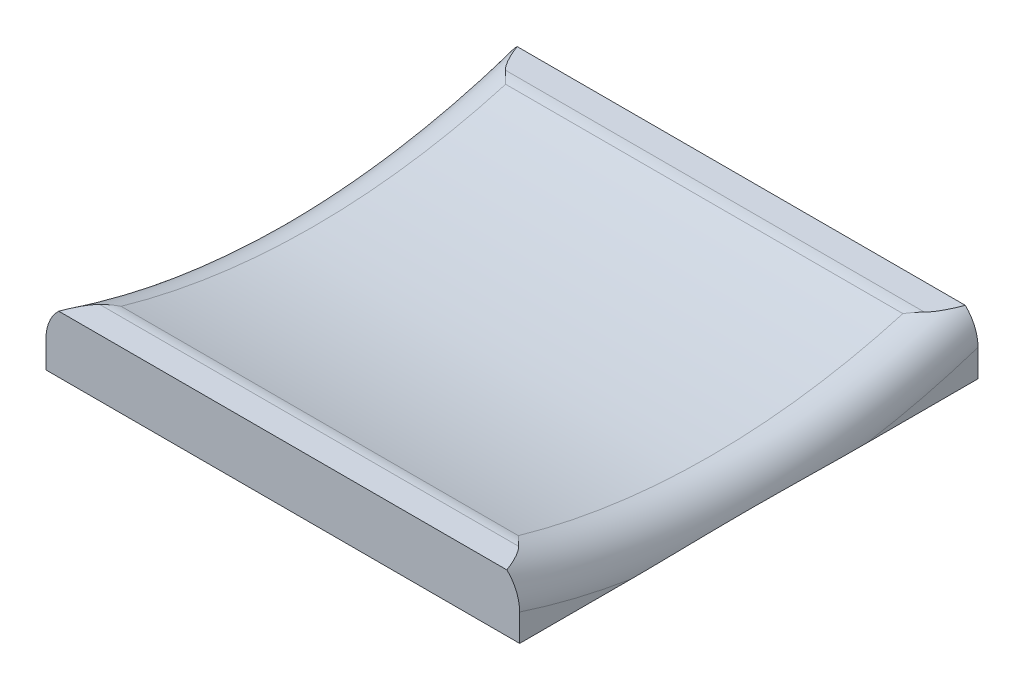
ISO-10303-21;
HEADER;
FILE_DESCRIPTION(('STEP AP214'),'2;1');
FILE_NAME('part.step','',(''),(''),'','','');
FILE_SCHEMA(('AUTOMOTIVE_DESIGN { 1 0 10303 214 1 1 1 1 }'));
ENDSEC;
DATA;
#1=APPLICATION_CONTEXT('core data for automotive mechanical design processes');
#2=APPLICATION_PROTOCOL_DEFINITION('international standard','automotive_design',2000,#1);
#3=PRODUCT_CONTEXT('',#1,'mechanical');
#4=PRODUCT('Part','Part','',(#3));
#5=PRODUCT_RELATED_PRODUCT_CATEGORY('part','',(#4));
#6=PRODUCT_DEFINITION_FORMATION('','',#4);
#7=PRODUCT_DEFINITION_CONTEXT('part definition',#1,'design');
#8=PRODUCT_DEFINITION('design','',#6,#7);
#9=PRODUCT_DEFINITION_SHAPE('','',#8);
#10=(LENGTH_UNIT() NAMED_UNIT(*) SI_UNIT(.MILLI.,.METRE.));
#11=(NAMED_UNIT(*) PLANE_ANGLE_UNIT() SI_UNIT($,.RADIAN.));
#12=(NAMED_UNIT(*) SI_UNIT($,.STERADIAN.) SOLID_ANGLE_UNIT());
#13=UNCERTAINTY_MEASURE_WITH_UNIT(LENGTH_MEASURE(1.E-05),#10,'distance_accuracy_value','');
#14=(GEOMETRIC_REPRESENTATION_CONTEXT(3) GLOBAL_UNCERTAINTY_ASSIGNED_CONTEXT((#13)) GLOBAL_UNIT_ASSIGNED_CONTEXT((#10,
#11,#12)) REPRESENTATION_CONTEXT('',''));
#15=CARTESIAN_POINT('',(0.,0.,0.));
#16=DIRECTION('',(0.,0.,1.));
#17=DIRECTION('',(1.,0.,0.));
#18=AXIS2_PLACEMENT_3D('',#15,#16,#17);
#19=CARTESIAN_POINT('',(78.74,0.,0.));
#20=DIRECTION('',(1.,0.,0.));
#21=DIRECTION('',(0.,0.,-1.));
#22=AXIS2_PLACEMENT_3D('',#19,#20,#21);
#23=PLANE('',#22);
#24=DIRECTION('',(0.,1.,0.));
#25=VECTOR('',#24,1.);
#26=CARTESIAN_POINT('',(78.74,9.525,-76.2));
#27=LINE('',#26,#25);
#28=CARTESIAN_POINT('',(78.74,-9.525,-76.2));
#29=VERTEX_POINT('',#28);
#30=CARTESIAN_POINT('',(78.74,-0.474716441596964,-76.2));
#31=VERTEX_POINT('',#30);
#32=EDGE_CURVE('E143',#29,#31,#27,.T.);
#33=ORIENTED_EDGE('',*,*,#32,.T.);
#34=CARTESIAN_POINT('',(78.74,230.889342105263,0.));
#35=DIRECTION('',(1.,0.,0.));
#36=DIRECTION('',(0.,0.,-1.));
#37=AXIS2_PLACEMENT_3D('',#34,#35,#36);
#38=CIRCLE('',#37,243.589342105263);
#39=CARTESIAN_POINT('',(78.74,-9.525,-39.2009144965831));
#40=VERTEX_POINT('',#39);
#41=EDGE_CURVE('E11',#31,#40,#38,.F.);
#42=ORIENTED_EDGE('',*,*,#41,.T.);
#43=DIRECTION('',(0.,0.,-1.));
#44=VECTOR('',#43,1.);
#45=CARTESIAN_POINT('',(78.74,-9.525,76.2));
#46=LINE('',#45,#44);
#47=EDGE_CURVE('E142',#40,#29,#46,.T.);
#48=ORIENTED_EDGE('',*,*,#47,.T.);
#49=EDGE_LOOP('',(#33,#42,#48));
#50=FACE_BOUND('',#49,.T.);
#51=ADVANCED_FACE('F41',(#50),#23,.T.);
#52=CARTESIAN_POINT('',(-78.74,0.,0.));
#53=DIRECTION('',(1.,0.,0.));
#54=DIRECTION('',(0.,0.,-1.));
#55=AXIS2_PLACEMENT_3D('',#52,#53,#54);
#56=PLANE('',#55);
#57=DIRECTION('',(0.,-1.,0.));
#58=VECTOR('',#57,1.);
#59=CARTESIAN_POINT('',(-78.74,9.525,76.2));
#60=LINE('',#59,#58);
#61=CARTESIAN_POINT('',(-78.74,-0.474716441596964,76.2));
#62=VERTEX_POINT('',#61);
#63=CARTESIAN_POINT('',(-78.74,-9.525,76.2));
#64=VERTEX_POINT('',#63);
#65=EDGE_CURVE('E150',#62,#64,#60,.T.);
#66=ORIENTED_EDGE('',*,*,#65,.F.);
#67=CARTESIAN_POINT('',(-78.74,230.889342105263,0.));
#68=DIRECTION('',(1.,0.,0.));
#69=DIRECTION('',(0.,0.,-1.));
#70=AXIS2_PLACEMENT_3D('',#67,#68,#69);
#71=CIRCLE('',#70,243.589342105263);
#72=CARTESIAN_POINT('',(-78.74,-9.525,39.2009144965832));
#73=VERTEX_POINT('',#72);
#74=EDGE_CURVE('E276',#62,#73,#71,.T.);
#75=ORIENTED_EDGE('',*,*,#74,.T.);
#76=DIRECTION('',(0.,0.,-1.));
#77=VECTOR('',#76,1.);
#78=CARTESIAN_POINT('',(-78.74,-9.525,76.2));
#79=LINE('',#78,#77);
#80=EDGE_CURVE('E171',#64,#73,#79,.T.);
#81=ORIENTED_EDGE('',*,*,#80,.F.);
#82=EDGE_LOOP('',(#66,#75,#81));
#83=FACE_BOUND('',#82,.T.);
#84=ADVANCED_FACE('F205',(#83),#56,.F.);
#85=CARTESIAN_POINT('',(78.74,9.525,76.2));
#86=DIRECTION('',(0.,-1.,0.));
#87=DIRECTION('',(0.,0.,-1.));
#88=AXIS2_PLACEMENT_3D('',#85,#86,#87);
#89=PLANE('',#88);
#90=DIRECTION('',(1.,0.,0.));
#91=VECTOR('',#90,1.);
#92=CARTESIAN_POINT('',(-78.74,9.525,67.4511033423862));
#93=LINE('',#92,#91);
#94=CARTESIAN_POINT('',(69.6481336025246,9.525,67.4511033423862));
#95=VERTEX_POINT('',#94);
#96=CARTESIAN_POINT('',(-69.6481336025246,9.525,67.4511033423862));
#97=VERTEX_POINT('',#96);
#98=EDGE_CURVE('E185',#95,#97,#93,.F.);
#99=ORIENTED_EDGE('',*,*,#98,.T.);
#100=CARTESIAN_POINT('',(-69.6481336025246,9.525,67.4511033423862));
#101=CARTESIAN_POINT('',(-69.7442889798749,9.525,67.5488738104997));
#102=CARTESIAN_POINT('',(-69.8384149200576,9.525,67.6485988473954));
#103=CARTESIAN_POINT('',(-70.0228799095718,9.525,67.8514411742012));
#104=CARTESIAN_POINT('',(-70.1132200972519,9.525,67.9545574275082));
#105=CARTESIAN_POINT('',(-70.3788033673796,9.525,68.2680118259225));
#106=CARTESIAN_POINT('',(-70.5488805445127,9.525,68.4827360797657));
#107=CARTESIAN_POINT('',(-70.8764771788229,9.525,68.9200956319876));
#108=CARTESIAN_POINT('',(-71.0340450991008,9.525,69.142695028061));
#109=CARTESIAN_POINT('',(-71.3390558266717,9.525,69.5948277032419));
#110=CARTESIAN_POINT('',(-71.4864945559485,9.525,69.8243637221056));
#111=CARTESIAN_POINT('',(-71.7709310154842,9.525,70.2864185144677));
#112=CARTESIAN_POINT('',(-71.9080233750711,9.525,70.5188793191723));
#113=CARTESIAN_POINT('',(-72.1744744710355,9.525,70.9881368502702));
#114=CARTESIAN_POINT('',(-72.3038342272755,9.525,71.2249329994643));
#115=CARTESIAN_POINT('',(-72.5557983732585,9.525,71.7024086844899));
#116=CARTESIAN_POINT('',(-72.6783953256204,9.525,71.9430921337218));
#117=CARTESIAN_POINT('',(-72.9173628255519,9.525,72.4275259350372));
#118=CARTESIAN_POINT('',(-73.0337333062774,9.525,72.6712763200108));
#119=CARTESIAN_POINT('',(-73.2713204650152,9.525,73.18408095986));
#120=CARTESIAN_POINT('',(-73.3919886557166,9.525,73.453388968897));
#121=CARTESIAN_POINT('',(-73.6271116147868,9.525,73.9945374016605));
#122=CARTESIAN_POINT('',(-73.7415694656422,9.525,74.2663764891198));
#123=CARTESIAN_POINT('',(-73.9654882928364,9.525,74.8139363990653));
#124=CARTESIAN_POINT('',(-74.0749165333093,9.525,75.0896705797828));
#125=CARTESIAN_POINT('',(-74.2885236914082,9.525,75.6433087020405));
#126=CARTESIAN_POINT('',(-74.3927002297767,9.525,75.921213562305));
#127=CARTESIAN_POINT('',(-74.49443146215,9.525,76.2));
#128=B_SPLINE_CURVE_WITH_KNOTS('',3,(#100,#101,#102,#103,#104,#105,#106,#107,#108,#109,#110,
#111,#112,#113,#114,#115,#116,#117,#118,#119,#120,#121,#122,#123,#124,#125,#126,#127),
.UNSPECIFIED.,.F.,.F.,(4,2,2,2,2,2,2,2,2,2,2,2,2,4),(0.,0.41131776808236,0.822510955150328,
1.64372907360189,2.46159230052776,3.27978289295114,4.08924231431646,4.89859473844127,
5.70882019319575,6.5190543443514,7.40428688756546,8.28907595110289,9.17898330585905,
10.0692902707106),.UNSPECIFIED.);
#129=CARTESIAN_POINT('',(-74.49443146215,9.525,76.2));
#130=VERTEX_POINT('',#129);
#131=EDGE_CURVE('E193',#97,#130,#128,.T.);
#132=ORIENTED_EDGE('',*,*,#131,.T.);
#133=DIRECTION('',(-1.,0.,0.));
#134=VECTOR('',#133,1.);
#135=CARTESIAN_POINT('',(78.74,9.525,76.2));
#136=LINE('',#135,#134);
#137=CARTESIAN_POINT('',(74.49443146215,9.525,76.2));
#138=VERTEX_POINT('',#137);
#139=EDGE_CURVE('E154',#138,#130,#136,.T.);
#140=ORIENTED_EDGE('',*,*,#139,.F.);
#141=CARTESIAN_POINT('',(74.49443146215,9.525,76.2));
#142=CARTESIAN_POINT('',(74.3798709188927,9.525,75.8860786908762));
#143=CARTESIAN_POINT('',(74.2622187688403,9.525,75.5732679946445));
#144=CARTESIAN_POINT('',(74.0200997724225,9.525,74.9502193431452));
#145=CARTESIAN_POINT('',(73.8956314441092,9.525,74.6399819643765));
#146=CARTESIAN_POINT('',(73.6386390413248,9.525,74.0209814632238));
#147=CARTESIAN_POINT('',(73.5060768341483,9.525,73.7122341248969));
#148=CARTESIAN_POINT('',(73.2326961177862,9.525,73.0984345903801));
#149=CARTESIAN_POINT('',(73.0918782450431,9.525,72.7933821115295));
#150=CARTESIAN_POINT('',(72.8042239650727,9.525,72.1944186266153));
#151=CARTESIAN_POINT('',(72.6575902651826,9.525,71.9004105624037));
#152=CARTESIAN_POINT('',(72.3543438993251,9.525,71.317592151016));
#153=CARTESIAN_POINT('',(72.1977320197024,9.525,71.0287813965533));
#154=CARTESIAN_POINT('',(71.8733708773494,9.525,70.4581777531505));
#155=CARTESIAN_POINT('',(71.7056431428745,9.525,70.1763726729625));
#156=CARTESIAN_POINT('',(71.3569823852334,9.525,69.6211024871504));
#157=CARTESIAN_POINT('',(71.176053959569,9.525,69.3476345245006));
#158=CARTESIAN_POINT('',(70.8863189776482,9.525,68.9362713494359));
#159=CARTESIAN_POINT('',(70.7830810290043,9.525,68.794445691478));
#160=CARTESIAN_POINT('',(70.5716769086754,9.525,68.5145224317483));
#161=CARTESIAN_POINT('',(70.463511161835,9.525,68.3764245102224));
#162=CARTESIAN_POINT('',(70.2411326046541,9.525,68.1038856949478));
#163=CARTESIAN_POINT('',(70.1268896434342,9.525,67.9694692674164));
#164=CARTESIAN_POINT('',(69.8922583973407,9.525,67.7059994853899));
#165=CARTESIAN_POINT('',(69.771866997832,9.525,67.5769489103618));
#166=CARTESIAN_POINT('',(69.6481336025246,9.525,67.4511033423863));
#167=B_SPLINE_CURVE_WITH_KNOTS('',3,(#141,#142,#143,#144,#145,#146,#147,#148,#149,#150,#151,
#152,#153,#154,#155,#156,#157,#158,#159,#160,#161,#162,#163,#164,#165,#166),.UNSPECIFIED.,.F.,
.F.,(4,2,2,2,2,2,2,2,2,2,2,2,4),(0.,1.00252334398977,2.00526552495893,3.01316395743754,
4.02098479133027,5.00645704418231,5.99185173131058,6.97539081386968,7.95858897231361,
8.48476337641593,9.01089250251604,9.53993312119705,10.0692444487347),.UNSPECIFIED.);
#168=EDGE_CURVE('E187',#138,#95,#167,.T.);
#169=ORIENTED_EDGE('',*,*,#168,.T.);
#170=EDGE_LOOP('',(#99,#132,#140,#169));
#171=FACE_BOUND('',#170,.T.);
#172=ADVANCED_FACE('F199',(#171),#89,.F.);
#173=DIRECTION('',(-1.,0.,0.));
#174=VECTOR('',#173,1.);
#175=CARTESIAN_POINT('',(78.74,9.525,-76.2));
#176=LINE('',#175,#174);
#177=CARTESIAN_POINT('',(74.49443146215,9.525,-76.2));
#178=VERTEX_POINT('',#177);
#179=CARTESIAN_POINT('',(-74.49443146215,9.525,-76.2));
#180=VERTEX_POINT('',#179);
#181=EDGE_CURVE('E174',#178,#180,#176,.T.);
#182=ORIENTED_EDGE('',*,*,#181,.T.);
#183=CARTESIAN_POINT('',(-74.49443146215,9.525,-76.2));
#184=CARTESIAN_POINT('',(-74.3798709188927,9.525,-75.8860786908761));
#185=CARTESIAN_POINT('',(-74.2622187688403,9.525,-75.5732679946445));
#186=CARTESIAN_POINT('',(-74.0200997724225,9.525,-74.9502193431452));
#187=CARTESIAN_POINT('',(-73.8956314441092,9.525,-74.6399819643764));
#188=CARTESIAN_POINT('',(-73.6386390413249,9.525,-74.0209814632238));
#189=CARTESIAN_POINT('',(-73.5060768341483,9.525,-73.7122341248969));
#190=CARTESIAN_POINT('',(-73.2326961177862,9.525,-73.0984345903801));
#191=CARTESIAN_POINT('',(-73.0918782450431,9.525,-72.7933821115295));
#192=CARTESIAN_POINT('',(-72.8042239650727,9.525,-72.1944186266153));
#193=CARTESIAN_POINT('',(-72.6575902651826,9.525,-71.9004105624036));
#194=CARTESIAN_POINT('',(-72.3543438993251,9.525,-71.3175921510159));
#195=CARTESIAN_POINT('',(-72.1977320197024,9.525,-71.0287813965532));
#196=CARTESIAN_POINT('',(-71.8733708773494,9.525,-70.4581777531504));
#197=CARTESIAN_POINT('',(-71.7056431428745,9.525,-70.1763726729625));
#198=CARTESIAN_POINT('',(-71.3569823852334,9.525,-69.6211024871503));
#199=CARTESIAN_POINT('',(-71.176053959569,9.525,-69.3476345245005));
#200=CARTESIAN_POINT('',(-70.8863189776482,9.525,-68.9362713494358));
#201=CARTESIAN_POINT('',(-70.7830810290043,9.525,-68.7944456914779));
#202=CARTESIAN_POINT('',(-70.5716769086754,9.525,-68.5145224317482));
#203=CARTESIAN_POINT('',(-70.463511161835,9.525,-68.3764245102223));
#204=CARTESIAN_POINT('',(-70.2411326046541,9.525,-68.1038856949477));
#205=CARTESIAN_POINT('',(-70.1268896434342,9.525,-67.9694692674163));
#206=CARTESIAN_POINT('',(-69.8922583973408,9.525,-67.7059994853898));
#207=CARTESIAN_POINT('',(-69.7718669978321,9.525,-67.5769489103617));
#208=CARTESIAN_POINT('',(-69.6481336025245,9.525,-67.4511033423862));
#209=B_SPLINE_CURVE_WITH_KNOTS('',3,(#183,#184,#185,#186,#187,#188,#189,#190,#191,#192,#193,
#194,#195,#196,#197,#198,#199,#200,#201,#202,#203,#204,#205,#206,#207,#208),.UNSPECIFIED.,.F.,
.F.,(4,2,2,2,2,2,2,2,2,2,2,2,4),(0.,1.00252334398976,2.00526552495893,3.01316395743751,
4.02098479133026,5.0064570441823,5.99185173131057,6.97539081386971,7.95858897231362,
8.48476337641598,9.0108925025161,9.53993312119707,10.0692444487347),.UNSPECIFIED.);
#210=CARTESIAN_POINT('',(-69.6481336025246,9.525,-67.4511033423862));
#211=VERTEX_POINT('',#210);
#212=EDGE_CURVE('E67',#180,#211,#209,.T.);
#213=ORIENTED_EDGE('',*,*,#212,.T.);
#214=DIRECTION('',(1.,0.,0.));
#215=VECTOR('',#214,1.);
#216=CARTESIAN_POINT('',(78.74,9.525,-67.4511033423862));
#217=LINE('',#216,#215);
#218=CARTESIAN_POINT('',(69.6481336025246,9.525,-67.4511033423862));
#219=VERTEX_POINT('',#218);
#220=EDGE_CURVE('E62',#211,#219,#217,.T.);
#221=ORIENTED_EDGE('',*,*,#220,.T.);
#222=CARTESIAN_POINT('',(69.6481336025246,9.525,-67.4511033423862));
#223=CARTESIAN_POINT('',(69.7442889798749,9.525,-67.5488738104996));
#224=CARTESIAN_POINT('',(69.8384149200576,9.525,-67.6485988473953));
#225=CARTESIAN_POINT('',(70.0228799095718,9.525,-67.8514411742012));
#226=CARTESIAN_POINT('',(70.1132200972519,9.525,-67.9545574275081));
#227=CARTESIAN_POINT('',(70.3788033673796,9.525,-68.2680118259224));
#228=CARTESIAN_POINT('',(70.5488805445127,9.525,-68.4827360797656));
#229=CARTESIAN_POINT('',(70.8764771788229,9.525,-68.9200956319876));
#230=CARTESIAN_POINT('',(71.0340450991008,9.525,-69.1426950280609));
#231=CARTESIAN_POINT('',(71.3390558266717,9.525,-69.5948277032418));
#232=CARTESIAN_POINT('',(71.4864945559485,9.525,-69.8243637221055));
#233=CARTESIAN_POINT('',(71.7709310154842,9.525,-70.2864185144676));
#234=CARTESIAN_POINT('',(71.9080233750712,9.525,-70.5188793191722));
#235=CARTESIAN_POINT('',(72.1744744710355,9.525,-70.9881368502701));
#236=CARTESIAN_POINT('',(72.3038342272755,9.525,-71.2249329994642));
#237=CARTESIAN_POINT('',(72.5557983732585,9.525,-71.7024086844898));
#238=CARTESIAN_POINT('',(72.6783953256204,9.525,-71.9430921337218));
#239=CARTESIAN_POINT('',(72.9173628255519,9.525,-72.4275259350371));
#240=CARTESIAN_POINT('',(73.0337333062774,9.525,-72.6712763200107));
#241=CARTESIAN_POINT('',(73.2713204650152,9.525,-73.1840809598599));
#242=CARTESIAN_POINT('',(73.3919886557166,9.525,-73.4533889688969));
#243=CARTESIAN_POINT('',(73.6271116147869,9.525,-73.9945374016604));
#244=CARTESIAN_POINT('',(73.7415694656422,9.525,-74.2663764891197));
#245=CARTESIAN_POINT('',(73.9654882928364,9.525,-74.8139363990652));
#246=CARTESIAN_POINT('',(74.0749165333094,9.525,-75.0896705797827));
#247=CARTESIAN_POINT('',(74.2885236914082,9.525,-75.6433087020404));
#248=CARTESIAN_POINT('',(74.3927002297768,9.525,-75.9212135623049));
#249=CARTESIAN_POINT('',(74.4944314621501,9.525,-76.2));
#250=B_SPLINE_CURVE_WITH_KNOTS('',3,(#222,#223,#224,#225,#226,#227,#228,#229,#230,#231,#232,
#233,#234,#235,#236,#237,#238,#239,#240,#241,#242,#243,#244,#245,#246,#247,#248,#249),
.UNSPECIFIED.,.F.,.F.,(4,2,2,2,2,2,2,2,2,2,2,2,2,4),(0.,0.41131776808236,0.822510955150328,
1.64372907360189,2.46159230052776,3.27978289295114,4.08924231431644,4.89859473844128,
5.70882019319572,6.51905434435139,7.40428688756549,8.28907595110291,9.17898330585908,
10.0692902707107),.UNSPECIFIED.);
#251=EDGE_CURVE('E216',#219,#178,#250,.T.);
#252=ORIENTED_EDGE('',*,*,#251,.T.);
#253=EDGE_LOOP('',(#182,#213,#221,#252));
#254=FACE_BOUND('',#253,.T.);
#255=ADVANCED_FACE('F204',(#254),#89,.F.);
#256=CARTESIAN_POINT('',(78.74,-9.525,76.2));
#257=VERTEX_POINT('',#256);
#258=CARTESIAN_POINT('',(78.74,-9.52499999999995,39.2009144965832));
#259=VERTEX_POINT('',#258);
#260=EDGE_CURVE('E138',#257,#259,#46,.T.);
#261=ORIENTED_EDGE('',*,*,#260,.T.);
#262=CARTESIAN_POINT('',(78.74,230.889342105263,0.));
#263=DIRECTION('',(1.,0.,0.));
#264=DIRECTION('',(0.,0.,-1.));
#265=AXIS2_PLACEMENT_3D('',#262,#263,#264);
#266=CIRCLE('',#265,243.589342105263);
#267=CARTESIAN_POINT('',(78.74,-0.474716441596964,76.2));
#268=VERTEX_POINT('',#267);
#269=EDGE_CURVE('E54',#259,#268,#266,.F.);
#270=ORIENTED_EDGE('',*,*,#269,.T.);
#271=DIRECTION('',(0.,-1.,0.));
#272=VECTOR('',#271,1.);
#273=CARTESIAN_POINT('',(78.74,9.525,76.2));
#274=LINE('',#273,#272);
#275=EDGE_CURVE('E134',#268,#257,#274,.T.);
#276=ORIENTED_EDGE('',*,*,#275,.T.);
#277=EDGE_LOOP('',(#261,#270,#276));
#278=FACE_BOUND('',#277,.T.);
#279=ADVANCED_FACE('F136',(#278),#23,.T.);
#280=CARTESIAN_POINT('',(-78.74,-9.52499999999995,-39.2009144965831));
#281=VERTEX_POINT('',#280);
#282=CARTESIAN_POINT('',(-78.74,-9.525,-76.2));
#283=VERTEX_POINT('',#282);
#284=EDGE_CURVE('E170',#281,#283,#79,.T.);
#285=ORIENTED_EDGE('',*,*,#284,.F.);
#286=CARTESIAN_POINT('',(-78.74,230.889342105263,0.));
#287=DIRECTION('',(1.,0.,0.));
#288=DIRECTION('',(0.,0.,-1.));
#289=AXIS2_PLACEMENT_3D('',#286,#287,#288);
#290=CIRCLE('',#289,243.589342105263);
#291=CARTESIAN_POINT('',(-78.74,-0.474716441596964,-76.2));
#292=VERTEX_POINT('',#291);
#293=EDGE_CURVE('E278',#281,#292,#290,.T.);
#294=ORIENTED_EDGE('',*,*,#293,.T.);
#295=DIRECTION('',(0.,1.,0.));
#296=VECTOR('',#295,1.);
#297=CARTESIAN_POINT('',(-78.74,9.525,-76.2));
#298=LINE('',#297,#296);
#299=EDGE_CURVE('E166',#283,#292,#298,.T.);
#300=ORIENTED_EDGE('',*,*,#299,.F.);
#301=EDGE_LOOP('',(#285,#294,#300));
#302=FACE_BOUND('',#301,.T.);
#303=ADVANCED_FACE('F287',(#302),#56,.F.);
#304=CARTESIAN_POINT('',(78.74,9.525,-76.2));
#305=DIRECTION('',(0.,0.,1.));
#306=DIRECTION('',(1.,0.,0.));
#307=AXIS2_PLACEMENT_3D('',#304,#305,#306);
#308=PLANE('',#307);
#309=ORIENTED_EDGE('',*,*,#299,.T.);
#310=CARTESIAN_POINT('',(-78.74,-0.474716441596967,-76.2));
#311=CARTESIAN_POINT('',(-78.7400274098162,-0.0824941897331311,-76.2));
#312=CARTESIAN_POINT('',(-78.7236092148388,0.309724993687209,-76.2));
#313=CARTESIAN_POINT('',(-78.6581259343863,1.0914563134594,-76.2));
#314=CARTESIAN_POINT('',(-78.6090585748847,1.48096825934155,-76.2));
#315=CARTESIAN_POINT('',(-78.4783626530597,2.2554692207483,-76.2));
#316=CARTESIAN_POINT('',(-78.3966552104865,2.64044493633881,-76.2));
#317=CARTESIAN_POINT('',(-78.2011329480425,3.40213381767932,-76.2));
#318=CARTESIAN_POINT('',(-78.0873201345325,3.77884749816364,-76.2));
#319=CARTESIAN_POINT('',(-77.8280295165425,4.52173267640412,-76.2));
#320=CARTESIAN_POINT('',(-77.6825136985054,4.88789091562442,-76.2));
#321=CARTESIAN_POINT('',(-77.3606851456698,5.60641091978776,-76.2));
#322=CARTESIAN_POINT('',(-77.1843734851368,5.95877316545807,-76.2));
#323=CARTESIAN_POINT('',(-76.8024001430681,6.64609773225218,-76.2));
#324=CARTESIAN_POINT('',(-76.5968106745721,6.98110017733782,-76.2));
#325=CARTESIAN_POINT('',(-76.157239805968,7.63172971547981,-76.2));
#326=CARTESIAN_POINT('',(-75.9232731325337,7.94736673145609,-76.2));
#327=CARTESIAN_POINT('',(-75.4931043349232,8.47694042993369,-76.2));
#328=CARTESIAN_POINT('',(-75.3030314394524,8.69588366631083,-76.2));
#329=CARTESIAN_POINT('',(-74.9090040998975,9.1205513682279,-76.2));
#330=CARTESIAN_POINT('',(-74.7050615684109,9.32628688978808,-76.2));
#331=CARTESIAN_POINT('',(-74.49443146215,9.525,-76.2));
#332=B_SPLINE_CURVE_WITH_KNOTS('',3,(#310,#311,#312,#313,#314,#315,#316,#317,#318,#319,#320,
#321,#322,#323,#324,#325,#326,#327,#328,#329,#330,#331),.UNSPECIFIED.,.F.,.F.,(4,2,2,2,2,2,2,2,
2,2,4),(0.,1.17631996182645,2.35272186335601,3.53198410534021,4.71117266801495,5.89178299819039,
7.07235215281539,8.25005833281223,9.4271559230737,10.296366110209,11.1648389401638),.UNSPECIFIED.);
#333=EDGE_CURVE('E262',#292,#180,#332,.T.);
#334=ORIENTED_EDGE('',*,*,#333,.T.);
#335=ORIENTED_EDGE('',*,*,#181,.F.);
#336=CARTESIAN_POINT('',(74.49443146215,9.525,-76.2));
#337=CARTESIAN_POINT('',(74.7706659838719,9.26442912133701,-76.2));
#338=CARTESIAN_POINT('',(75.0353912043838,8.99173322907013,-76.2));
#339=CARTESIAN_POINT('',(75.5402867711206,8.42461286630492,-76.2));
#340=CARTESIAN_POINT('',(75.780463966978,8.1301944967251,-76.2));
#341=CARTESIAN_POINT('',(76.2346346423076,7.52233505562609,-76.2));
#342=CARTESIAN_POINT('',(76.4486565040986,7.208915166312,-76.2));
#343=CARTESIAN_POINT('',(76.8496546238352,6.56522369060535,-76.2));
#344=CARTESIAN_POINT('',(77.0366300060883,6.23495155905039,-76.2));
#345=CARTESIAN_POINT('',(77.3824219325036,5.56026346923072,-76.2));
#346=CARTESIAN_POINT('',(77.5412567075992,5.21585684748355,-76.2));
#347=CARTESIAN_POINT('',(77.8301139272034,4.51516381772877,-76.2));
#348=CARTESIAN_POINT('',(77.9601357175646,4.15887714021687,-76.2));
#349=CARTESIAN_POINT('',(78.1906249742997,3.43719093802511,-76.2));
#350=CARTESIAN_POINT('',(78.2911159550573,3.07179891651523,-76.2));
#351=CARTESIAN_POINT('',(78.462161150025,2.33420542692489,-76.2));
#352=CARTESIAN_POINT('',(78.5327258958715,1.96200640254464,-76.2));
#353=CARTESIAN_POINT('',(78.638739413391,1.24603742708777,-76.2));
#354=CARTESIAN_POINT('',(78.6767275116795,0.902640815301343,-76.2));
#355=CARTESIAN_POINT('',(78.7273428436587,0.214592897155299,-76.2));
#356=CARTESIAN_POINT('',(78.7400146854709,-0.13005512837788,-76.2));
#357=CARTESIAN_POINT('',(78.74,-0.474716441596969,-76.2));
#358=B_SPLINE_CURVE_WITH_KNOTS('',3,(#336,#337,#338,#339,#340,#341,#342,#343,#344,#345,#346,
#347,#348,#349,#350,#351,#352,#353,#354,#355,#356,#357),.UNSPECIFIED.,.F.,.F.,(4,2,2,2,2,2,2,2,
2,2,4),(0.,1.13878120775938,2.27724378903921,3.41445979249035,4.55171260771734,5.68822593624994,
6.82476506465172,7.96039673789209,9.09562842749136,10.1311809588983,11.1649071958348),.UNSPECIFIED.);
#359=EDGE_CURVE('E266',#178,#31,#358,.T.);
#360=ORIENTED_EDGE('',*,*,#359,.T.);
#361=ORIENTED_EDGE('',*,*,#32,.F.);
#362=DIRECTION('',(-1.,0.,0.));
#363=VECTOR('',#362,1.);
#364=CARTESIAN_POINT('',(78.74,-9.525,-76.2));
#365=LINE('',#364,#363);
#366=EDGE_CURVE('E155',#29,#283,#365,.T.);
#367=ORIENTED_EDGE('',*,*,#366,.T.);
#368=EDGE_LOOP('',(#309,#334,#335,#360,#361,#367));
#369=FACE_BOUND('',#368,.T.);
#370=ADVANCED_FACE('F209',(#369),#308,.F.);
#371=CARTESIAN_POINT('',(78.74,9.525,76.2));
#372=DIRECTION('',(0.,0.,-1.));
#373=DIRECTION('',(-1.,0.,0.));
#374=AXIS2_PLACEMENT_3D('',#371,#372,#373);
#375=PLANE('',#374);
#376=ORIENTED_EDGE('',*,*,#139,.T.);
#377=CARTESIAN_POINT('',(-74.49443146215,9.525,76.2));
#378=CARTESIAN_POINT('',(-74.7706659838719,9.26442912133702,76.2));
#379=CARTESIAN_POINT('',(-75.0353912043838,8.99173322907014,76.2));
#380=CARTESIAN_POINT('',(-75.5402867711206,8.42461286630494,76.2));
#381=CARTESIAN_POINT('',(-75.780463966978,8.13019449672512,76.2));
#382=CARTESIAN_POINT('',(-76.2346346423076,7.52233505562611,76.2));
#383=CARTESIAN_POINT('',(-76.4486565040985,7.20891516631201,76.2));
#384=CARTESIAN_POINT('',(-76.8496546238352,6.56522369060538,76.2));
#385=CARTESIAN_POINT('',(-77.0366300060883,6.23495155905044,76.2));
#386=CARTESIAN_POINT('',(-77.3824219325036,5.56026346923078,76.2));
#387=CARTESIAN_POINT('',(-77.5412567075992,5.21585684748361,76.2));
#388=CARTESIAN_POINT('',(-77.8301139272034,4.51516381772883,76.2));
#389=CARTESIAN_POINT('',(-77.9601357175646,4.15887714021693,76.2));
#390=CARTESIAN_POINT('',(-78.1906249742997,3.43719093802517,76.2));
#391=CARTESIAN_POINT('',(-78.2911159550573,3.0717989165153,76.2));
#392=CARTESIAN_POINT('',(-78.462161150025,2.33420542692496,76.2));
#393=CARTESIAN_POINT('',(-78.5327258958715,1.96200640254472,76.2));
#394=CARTESIAN_POINT('',(-78.638739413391,1.24603742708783,76.2));
#395=CARTESIAN_POINT('',(-78.6767275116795,0.902640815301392,76.2));
#396=CARTESIAN_POINT('',(-78.7273428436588,0.214592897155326,76.2));
#397=CARTESIAN_POINT('',(-78.7400146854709,-0.130055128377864,76.2));
#398=CARTESIAN_POINT('',(-78.74,-0.474716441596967,76.2));
#399=B_SPLINE_CURVE_WITH_KNOTS('',3,(#377,#378,#379,#380,#381,#382,#383,#384,#385,#386,#387,
#388,#389,#390,#391,#392,#393,#394,#395,#396,#397,#398),.UNSPECIFIED.,.F.,.F.,(4,2,2,2,2,2,2,2,
2,2,4),(0.,1.13878120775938,2.2772437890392,3.41445979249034,4.55171260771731,5.6882259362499,
6.82476506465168,7.96039673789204,9.09562842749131,10.1311809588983,11.1649071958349),.UNSPECIFIED.);
#400=EDGE_CURVE('E250',#130,#62,#399,.T.);
#401=ORIENTED_EDGE('',*,*,#400,.T.);
#402=ORIENTED_EDGE('',*,*,#65,.T.);
#403=DIRECTION('',(-1.,0.,0.));
#404=VECTOR('',#403,1.);
#405=CARTESIAN_POINT('',(78.74,-9.525,76.2));
#406=LINE('',#405,#404);
#407=EDGE_CURVE('E146',#257,#64,#406,.T.);
#408=ORIENTED_EDGE('',*,*,#407,.F.);
#409=ORIENTED_EDGE('',*,*,#275,.F.);
#410=CARTESIAN_POINT('',(78.74,-0.474716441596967,76.2));
#411=CARTESIAN_POINT('',(78.7400274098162,-0.0824941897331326,76.2));
#412=CARTESIAN_POINT('',(78.7236092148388,0.309724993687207,76.2));
#413=CARTESIAN_POINT('',(78.6581259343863,1.0914563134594,76.2));
#414=CARTESIAN_POINT('',(78.6090585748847,1.48096825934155,76.2));
#415=CARTESIAN_POINT('',(78.4783626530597,2.2554692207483,76.2));
#416=CARTESIAN_POINT('',(78.3966552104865,2.64044493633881,76.2));
#417=CARTESIAN_POINT('',(78.2011329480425,3.40213381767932,76.2));
#418=CARTESIAN_POINT('',(78.0873201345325,3.77884749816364,76.2));
#419=CARTESIAN_POINT('',(77.8280295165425,4.52173267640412,76.2));
#420=CARTESIAN_POINT('',(77.6825136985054,4.88789091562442,76.2));
#421=CARTESIAN_POINT('',(77.3606851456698,5.60641091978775,76.2));
#422=CARTESIAN_POINT('',(77.1843734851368,5.95877316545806,76.2));
#423=CARTESIAN_POINT('',(76.8024001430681,6.64609773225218,76.2));
#424=CARTESIAN_POINT('',(76.5968106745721,6.98110017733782,76.2));
#425=CARTESIAN_POINT('',(76.157239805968,7.63172971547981,76.2));
#426=CARTESIAN_POINT('',(75.9232731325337,7.94736673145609,76.2));
#427=CARTESIAN_POINT('',(75.4931043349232,8.47694042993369,76.2));
#428=CARTESIAN_POINT('',(75.3030314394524,8.69588366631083,76.2));
#429=CARTESIAN_POINT('',(74.9090040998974,9.1205513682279,76.2));
#430=CARTESIAN_POINT('',(74.7050615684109,9.32628688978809,76.2));
#431=CARTESIAN_POINT('',(74.49443146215,9.52500000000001,76.2));
#432=B_SPLINE_CURVE_WITH_KNOTS('',3,(#410,#411,#412,#413,#414,#415,#416,#417,#418,#419,#420,
#421,#422,#423,#424,#425,#426,#427,#428,#429,#430,#431),.UNSPECIFIED.,.F.,.F.,(4,2,2,2,2,2,2,2,
2,2,4),(0.,1.17631996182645,2.35272186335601,3.53198410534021,4.71117266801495,5.89178299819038,
7.07235215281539,8.25005833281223,9.42715592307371,10.296366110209,11.1648389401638),.UNSPECIFIED.);
#433=EDGE_CURVE('E310',#268,#138,#432,.T.);
#434=ORIENTED_EDGE('',*,*,#433,.T.);
#435=EDGE_LOOP('',(#376,#401,#402,#408,#409,#434));
#436=FACE_BOUND('',#435,.T.);
#437=ADVANCED_FACE('F148',(#436),#375,.F.);
#438=CARTESIAN_POINT('',(78.74,-9.525,76.2));
#439=DIRECTION('',(0.,1.,0.));
#440=DIRECTION('',(0.,0.,1.));
#441=AXIS2_PLACEMENT_3D('',#438,#439,#440);
#442=PLANE('',#441);
#443=ORIENTED_EDGE('',*,*,#80,.T.);
#444=CARTESIAN_POINT('',(-78.74,-9.52499999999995,39.2009144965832));
#445=CARTESIAN_POINT('',(-78.739976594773,-9.52499999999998,38.1424218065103));
#446=CARTESIAN_POINT('',(-78.7365724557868,-9.52499999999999,37.0839375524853));
#447=CARTESIAN_POINT('',(-78.7244514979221,-9.525,34.9670116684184));
#448=CARTESIAN_POINT('',(-78.7157347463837,-9.525,33.9085700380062));
#449=CARTESIAN_POINT('',(-78.694437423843,-9.525,31.7917429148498));
#450=CARTESIAN_POINT('',(-78.681856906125,-9.525,30.7333574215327));
#451=CARTESIAN_POINT('',(-78.6541263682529,-9.525,28.616617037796));
#452=CARTESIAN_POINT('',(-78.6389763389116,-9.525,27.5582621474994));
#453=CARTESIAN_POINT('',(-78.6072973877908,-9.525,25.4416591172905));
#454=CARTESIAN_POINT('',(-78.5907685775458,-9.525,24.3834109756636));
#455=CARTESIAN_POINT('',(-78.5574038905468,-9.525,22.2669212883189));
#456=CARTESIAN_POINT('',(-78.5405680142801,-9.525,21.2086797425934));
#457=CARTESIAN_POINT('',(-78.5075467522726,-9.525,19.0921988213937));
#458=CARTESIAN_POINT('',(-78.4913613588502,-9.525,18.0339594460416));
#459=CARTESIAN_POINT('',(-78.4604765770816,-9.525,15.9174563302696));
#460=CARTESIAN_POINT('',(-78.4457771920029,-9.525,14.8591925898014));
#461=CARTESIAN_POINT('',(-78.4179843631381,-9.525,12.6968107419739));
#462=CARTESIAN_POINT('',(-78.4049880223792,-9.525,11.592691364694));
#463=CARTESIAN_POINT('',(-78.3820326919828,-9.525,9.3844205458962));
#464=CARTESIAN_POINT('',(-78.3720737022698,-9.525,8.28026910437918));
#465=CARTESIAN_POINT('',(-78.3556718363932,-9.525,6.07194274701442));
#466=CARTESIAN_POINT('',(-78.3492289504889,-9.525,4.96776783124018));
#467=CARTESIAN_POINT('',(-78.3401622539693,-9.525,2.75940211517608));
#468=CARTESIAN_POINT('',(-78.3375384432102,-9.525,1.65521131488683));
#469=CARTESIAN_POINT('',(-78.3362318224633,-9.525,-0.553223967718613));
#470=CARTESIAN_POINT('',(-78.3375491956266,-9.525,-1.65746845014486));
#471=CARTESIAN_POINT('',(-78.3440641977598,-9.525,-3.86594579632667));
#472=CARTESIAN_POINT('',(-78.3492618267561,-9.525,-4.97017866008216));
#473=CARTESIAN_POINT('',(-78.363294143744,-9.525,-7.17862394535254));
#474=CARTESIAN_POINT('',(-78.3721288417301,-9.525,-8.28283636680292));
#475=CARTESIAN_POINT('',(-78.3930141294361,-9.525,-10.4912309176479));
#476=CARTESIAN_POINT('',(-78.4050647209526,-9.525,-11.5954130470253));
#477=CARTESIAN_POINT('',(-78.4317905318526,-9.525,-13.8038455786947));
#478=CARTESIAN_POINT('',(-78.4464659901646,-9.525,-14.9080959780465));
#479=CARTESIAN_POINT('',(-78.4776851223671,-9.525,-17.1165696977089));
#480=CARTESIAN_POINT('',(-78.4942287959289,-9.525,-18.2207930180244));
#481=CARTESIAN_POINT('',(-78.5282746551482,-9.525,-20.4292204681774));
#482=CARTESIAN_POINT('',(-78.5457768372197,-9.525,-21.5334245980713));
#483=CARTESIAN_POINT('',(-78.5806843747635,-9.525,-23.7418343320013));
#484=CARTESIAN_POINT('',(-78.5980897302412,-9.525,-24.8460399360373));
#485=CARTESIAN_POINT('',(-78.6316090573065,-9.525,-27.0543958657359));
#486=CARTESIAN_POINT('',(-78.6477231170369,-9.525,-28.1585461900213));
#487=CARTESIAN_POINT('',(-78.6773300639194,-9.525,-30.3668786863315));
#488=CARTESIAN_POINT('',(-78.6908229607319,-9.525,-31.4710608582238));
#489=CARTESIAN_POINT('',(-78.7137326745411,-9.525,-33.6794961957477));
#490=CARTESIAN_POINT('',(-78.7231493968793,-9.525,-34.7837493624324));
#491=CARTESIAN_POINT('',(-78.7362692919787,-9.525,-36.9923032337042));
#492=CARTESIAN_POINT('',(-78.7399723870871,-9.525,-38.0966039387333));
#493=CARTESIAN_POINT('',(-78.74,-9.525,-39.2009144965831));
#494=B_SPLINE_CURVE_WITH_KNOTS('',3,(#444,#445,#446,#447,#448,#449,#450,#451,#452,#453,#454,
#455,#456,#457,#458,#459,#460,#461,#462,#463,#464,#465,#466,#467,#468,#469,#470,#471,#472,#473,
#474,#475,#476,#477,#478,#479,#480,#481,#482,#483,#484,#485,#486,#487,#488,#489,#490,#491,#492,
#493),.UNSPECIFIED.,.F.,.F.,(4,2,2,2,2,2,2,2,2,2,2,2,2,2,2,2,2,2,2,2,2,2,2,2,4),(0.,
3.17546076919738,6.3508812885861,9.52625801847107,12.7016461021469,15.8767775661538,
19.0519039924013,22.2269929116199,25.4020888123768,28.7146730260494,32.0272571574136,
35.3398321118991,38.6524069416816,41.965135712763,45.2778645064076,48.5906024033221,
51.9033421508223,55.2163835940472,58.5294244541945,61.8424529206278,65.1554812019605,
68.4682831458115,71.7810728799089,75.0939395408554,78.4068512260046),.UNSPECIFIED.);
#495=EDGE_CURVE('E256',#73,#281,#494,.T.);
#496=ORIENTED_EDGE('',*,*,#495,.T.);
#497=ORIENTED_EDGE('',*,*,#284,.T.);
#498=ORIENTED_EDGE('',*,*,#366,.F.);
#499=ORIENTED_EDGE('',*,*,#47,.F.);
#500=CARTESIAN_POINT('',(78.74,-9.52499999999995,-39.2009144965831));
#501=CARTESIAN_POINT('',(78.739976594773,-9.52499999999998,-38.1424218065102));
#502=CARTESIAN_POINT('',(78.7365724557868,-9.52499999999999,-37.0839375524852));
#503=CARTESIAN_POINT('',(78.7244514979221,-9.525,-34.9670116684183));
#504=CARTESIAN_POINT('',(78.7157347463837,-9.525,-33.9085700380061));
#505=CARTESIAN_POINT('',(78.694437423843,-9.525,-31.7917429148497));
#506=CARTESIAN_POINT('',(78.681856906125,-9.525,-30.7333574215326));
#507=CARTESIAN_POINT('',(78.6541263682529,-9.525,-28.6166170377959));
#508=CARTESIAN_POINT('',(78.6389763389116,-9.525,-27.5582621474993));
#509=CARTESIAN_POINT('',(78.6072973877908,-9.525,-25.4416591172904));
#510=CARTESIAN_POINT('',(78.5907685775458,-9.525,-24.3834109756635));
#511=CARTESIAN_POINT('',(78.5574038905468,-9.525,-22.2669212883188));
#512=CARTESIAN_POINT('',(78.5405680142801,-9.525,-21.2086797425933));
#513=CARTESIAN_POINT('',(78.5075467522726,-9.525,-19.0921988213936));
#514=CARTESIAN_POINT('',(78.4913613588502,-9.525,-18.0339594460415));
#515=CARTESIAN_POINT('',(78.4604765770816,-9.525,-15.9174563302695));
#516=CARTESIAN_POINT('',(78.4457771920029,-9.525,-14.8591925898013));
#517=CARTESIAN_POINT('',(78.4179843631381,-9.525,-12.6968107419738));
#518=CARTESIAN_POINT('',(78.4049880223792,-9.525,-11.5926913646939));
#519=CARTESIAN_POINT('',(78.3820326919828,-9.525,-9.3844205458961));
#520=CARTESIAN_POINT('',(78.3720737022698,-9.525,-8.28026910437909));
#521=CARTESIAN_POINT('',(78.3556718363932,-9.525,-6.07194274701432));
#522=CARTESIAN_POINT('',(78.3492289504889,-9.525,-4.96776783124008));
#523=CARTESIAN_POINT('',(78.3401622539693,-9.525,-2.75940211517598));
#524=CARTESIAN_POINT('',(78.3375384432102,-9.525,-1.65521131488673));
#525=CARTESIAN_POINT('',(78.3362318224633,-9.525,0.553223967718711));
#526=CARTESIAN_POINT('',(78.3375491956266,-9.525,1.65746845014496));
#527=CARTESIAN_POINT('',(78.3440641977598,-9.525,3.86594579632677));
#528=CARTESIAN_POINT('',(78.3492618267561,-9.525,4.97017866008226));
#529=CARTESIAN_POINT('',(78.363294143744,-9.525,7.17862394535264));
#530=CARTESIAN_POINT('',(78.3721288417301,-9.525,8.28283636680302));
#531=CARTESIAN_POINT('',(78.3930141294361,-9.525,10.491230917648));
#532=CARTESIAN_POINT('',(78.4050647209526,-9.525,11.5954130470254));
#533=CARTESIAN_POINT('',(78.4317905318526,-9.525,13.8038455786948));
#534=CARTESIAN_POINT('',(78.4464659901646,-9.525,14.9080959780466));
#535=CARTESIAN_POINT('',(78.4776851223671,-9.525,17.116569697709));
#536=CARTESIAN_POINT('',(78.4942287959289,-9.525,18.2207930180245));
#537=CARTESIAN_POINT('',(78.5282746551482,-9.525,20.4292204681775));
#538=CARTESIAN_POINT('',(78.5457768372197,-9.525,21.5334245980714));
#539=CARTESIAN_POINT('',(78.5806843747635,-9.525,23.7418343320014));
#540=CARTESIAN_POINT('',(78.5980897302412,-9.525,24.8460399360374));
#541=CARTESIAN_POINT('',(78.6316090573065,-9.525,27.054395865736));
#542=CARTESIAN_POINT('',(78.6477231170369,-9.525,28.1585461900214));
#543=CARTESIAN_POINT('',(78.6773300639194,-9.525,30.3668786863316));
#544=CARTESIAN_POINT('',(78.6908229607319,-9.525,31.4710608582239));
#545=CARTESIAN_POINT('',(78.7137326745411,-9.525,33.6794961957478));
#546=CARTESIAN_POINT('',(78.7231493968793,-9.525,34.7837493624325));
#547=CARTESIAN_POINT('',(78.7362692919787,-9.525,36.9923032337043));
#548=CARTESIAN_POINT('',(78.7399723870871,-9.525,38.0966039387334));
#549=CARTESIAN_POINT('',(78.74,-9.525,39.2009144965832));
#550=B_SPLINE_CURVE_WITH_KNOTS('',3,(#500,#501,#502,#503,#504,#505,#506,#507,#508,#509,#510,
#511,#512,#513,#514,#515,#516,#517,#518,#519,#520,#521,#522,#523,#524,#525,#526,#527,#528,#529,
#530,#531,#532,#533,#534,#535,#536,#537,#538,#539,#540,#541,#542,#543,#544,#545,#546,#547,#548,
#549),.UNSPECIFIED.,.F.,.F.,(4,2,2,2,2,2,2,2,2,2,2,2,2,2,2,2,2,2,2,2,2,2,2,2,4),(0.,
3.17546076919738,6.3508812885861,9.52625801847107,12.7016461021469,15.8767775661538,
19.0519039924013,22.2269929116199,25.4020888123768,28.7146730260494,32.0272571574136,
35.3398321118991,38.6524069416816,41.965135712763,45.2778645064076,48.5906024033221,
51.9033421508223,55.2163835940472,58.5294244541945,61.8424529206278,65.1554812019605,
68.4682831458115,71.7810728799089,75.0939395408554,78.4068512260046),.UNSPECIFIED.);
#551=EDGE_CURVE('E160',#40,#259,#550,.T.);
#552=ORIENTED_EDGE('',*,*,#551,.T.);
#553=ORIENTED_EDGE('',*,*,#260,.F.);
#554=ORIENTED_EDGE('',*,*,#407,.T.);
#555=EDGE_LOOP('',(#443,#496,#497,#498,#499,#552,#553,#554));
#556=FACE_BOUND('',#555,.T.);
#557=ADVANCED_FACE('F157',(#556),#442,.F.);
#558=CARTESIAN_POINT('',(373.392648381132,230.889342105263,0.));
#559=DIRECTION('',(-1.,0.,0.));
#560=DIRECTION('',(0.,0.,1.));
#561=AXIS2_PLACEMENT_3D('',#558,#559,#560);
#562=CYLINDRICAL_SURFACE('',#561,230.889342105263);
#563=CARTESIAN_POINT('',(66.04,230.889342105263,0.));
#564=DIRECTION('',(1.,0.,0.));
#565=DIRECTION('',(0.,0.,-1.));
#566=AXIS2_PLACEMENT_3D('',#563,#564,#565);
#567=CIRCLE('',#566,230.889342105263);
#568=CARTESIAN_POINT('',(66.04,9.02839576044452,63.9344100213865));
#569=VERTEX_POINT('',#568);
#570=CARTESIAN_POINT('',(66.04,9.02839576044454,-63.9344100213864));
#571=VERTEX_POINT('',#570);
#572=EDGE_CURVE('E178',#569,#571,#567,.T.);
#573=ORIENTED_EDGE('',*,*,#572,.T.);
#574=DIRECTION('',(-1.,0.,0.));
#575=VECTOR('',#574,1.);
#576=CARTESIAN_POINT('',(373.392648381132,9.02839576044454,-63.9344100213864));
#577=LINE('',#576,#575);
#578=CARTESIAN_POINT('',(-66.04,9.02839576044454,-63.9344100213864));
#579=VERTEX_POINT('',#578);
#580=EDGE_CURVE('E183',#571,#579,#577,.T.);
#581=ORIENTED_EDGE('',*,*,#580,.T.);
#582=CARTESIAN_POINT('',(-66.04,230.889342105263,0.));
#583=DIRECTION('',(1.,0.,0.));
#584=DIRECTION('',(0.,0.,-1.));
#585=AXIS2_PLACEMENT_3D('',#582,#583,#584);
#586=CIRCLE('',#585,230.889342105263);
#587=CARTESIAN_POINT('',(-66.04,9.02839576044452,63.9344100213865));
#588=VERTEX_POINT('',#587);
#589=EDGE_CURVE('E180',#579,#588,#586,.F.);
#590=ORIENTED_EDGE('',*,*,#589,.T.);
#591=DIRECTION('',(-1.,0.,0.));
#592=VECTOR('',#591,1.);
#593=CARTESIAN_POINT('',(373.392648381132,9.02839576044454,63.9344100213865));
#594=LINE('',#593,#592);
#595=EDGE_CURVE('E176',#588,#569,#594,.F.);
#596=ORIENTED_EDGE('',*,*,#595,.T.);
#597=EDGE_LOOP('',(#573,#581,#590,#596));
#598=FACE_BOUND('',#597,.T.);
#599=ADVANCED_FACE('F286',(#598),#562,.F.);
#600=CARTESIAN_POINT('',(66.04,230.889342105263,0.));
#601=DIRECTION('',(1.,0.,0.));
#602=DIRECTION('',(0.,0.,-1.));
#603=AXIS2_PLACEMENT_3D('',#600,#601,#602);
#604=TOROIDAL_SURFACE('',#603,243.589342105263,12.7);
#605=ORIENTED_EDGE('',*,*,#359,.F.);
#606=ORIENTED_EDGE('',*,*,#251,.F.);
#607=CARTESIAN_POINT('',(69.6481336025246,9.525,-67.4511033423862));
#608=CARTESIAN_POINT('',(69.3524065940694,9.52497566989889,-67.1504729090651));
#609=CARTESIAN_POINT('',(69.0550374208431,9.51432530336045,-66.8514917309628));
#610=CARTESIAN_POINT('',(68.4578173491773,9.47228665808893,-66.2573676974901));
#611=CARTESIAN_POINT('',(68.1579659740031,9.44089429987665,-65.9622256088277));
#612=CARTESIAN_POINT('',(67.5581340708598,9.35808407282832,-65.3778343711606));
#613=CARTESIAN_POINT('',(67.2581609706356,9.30676236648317,-65.0885638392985));
#614=CARTESIAN_POINT('',(66.6574940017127,9.18443989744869,-64.5150892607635));
#615=CARTESIAN_POINT('',(66.3568003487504,9.11344443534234,-64.2308838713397));
#616=CARTESIAN_POINT('',(66.050766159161,9.03129508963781,-63.9444828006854));
#617=CARTESIAN_POINT('',(66.0453830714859,9.02984698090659,-63.9394459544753));
#618=CARTESIAN_POINT('',(66.04,9.02839576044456,-63.9344100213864));
#619=B_SPLINE_CURVE_WITH_KNOTS('',3,(#607,#608,#609,#610,#611,#612,#613,#614,#615,#616,#617,
#618),.UNSPECIFIED.,.F.,.F.,(4,2,2,2,2,4),(0.,1.26493603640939,2.53012093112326,
3.78927546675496,5.04809108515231,5.07062994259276),.UNSPECIFIED.);
#620=EDGE_CURVE('E46',#571,#219,#619,.F.);
#621=ORIENTED_EDGE('',*,*,#620,.F.);
#622=ORIENTED_EDGE('',*,*,#572,.F.);
#623=CARTESIAN_POINT('',(69.6481336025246,9.525,67.4511033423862));
#624=CARTESIAN_POINT('',(69.352406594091,9.5249756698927,67.1504729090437));
#625=CARTESIAN_POINT('',(69.0550374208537,9.51432530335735,66.851491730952));
#626=CARTESIAN_POINT('',(68.4578173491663,9.47228665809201,66.2573676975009));
#627=CARTESIAN_POINT('',(68.1579659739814,9.44089429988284,65.9622256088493));
#628=CARTESIAN_POINT('',(67.5581340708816,9.35808407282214,65.3778343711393));
#629=CARTESIAN_POINT('',(67.2581609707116,9.30676236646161,65.0885638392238));
#630=CARTESIAN_POINT('',(66.6574940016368,9.18443989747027,64.5150892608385));
#631=CARTESIAN_POINT('',(66.3568003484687,9.11344443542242,64.2308838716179));
#632=CARTESIAN_POINT('',(66.050766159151,9.03129508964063,63.9444828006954));
#633=CARTESIAN_POINT('',(66.0453830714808,9.02984698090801,63.9394459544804));
#634=CARTESIAN_POINT('',(66.04,9.02839576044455,63.9344100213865));
#635=B_SPLINE_CURVE_WITH_KNOTS('',3,(#623,#624,#625,#626,#627,#628,#629,#630,#631,#632,#633,
#634),.UNSPECIFIED.,.F.,.F.,(4,2,2,2,2,4),(0.,1.26493603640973,2.53012093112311,
3.78927546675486,5.04809108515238,5.07062994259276),.UNSPECIFIED.);
#636=EDGE_CURVE('E329',#95,#569,#635,.T.);
#637=ORIENTED_EDGE('',*,*,#636,.F.);
#638=ORIENTED_EDGE('',*,*,#168,.F.);
#639=ORIENTED_EDGE('',*,*,#433,.F.);
#640=ORIENTED_EDGE('',*,*,#269,.F.);
#641=ORIENTED_EDGE('',*,*,#551,.F.);
#642=ORIENTED_EDGE('',*,*,#41,.F.);
#643=EDGE_LOOP('',(#605,#606,#621,#622,#637,#638,#639,#640,#641,#642));
#644=FACE_BOUND('',#643,.T.);
#645=ADVANCED_FACE('F43',(#644),#604,.T.);
#646=CARTESIAN_POINT('',(373.392648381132,-3.17499999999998,-67.4511033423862));
#647=DIRECTION('',(-1.,0.,0.));
#648=DIRECTION('',(0.,0.,1.));
#649=AXIS2_PLACEMENT_3D('',#646,#647,#648);
#650=CYLINDRICAL_SURFACE('',#649,12.7);
#651=ORIENTED_EDGE('',*,*,#620,.T.);
#652=ORIENTED_EDGE('',*,*,#220,.F.);
#653=CARTESIAN_POINT('',(-69.6481336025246,9.525,-67.4511033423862));
#654=CARTESIAN_POINT('',(-69.3524065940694,9.52497566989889,-67.1504729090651));
#655=CARTESIAN_POINT('',(-69.0550374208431,9.51432530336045,-66.8514917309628));
#656=CARTESIAN_POINT('',(-68.4578173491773,9.47228665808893,-66.2573676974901));
#657=CARTESIAN_POINT('',(-68.1579659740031,9.44089429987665,-65.9622256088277));
#658=CARTESIAN_POINT('',(-67.5581340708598,9.35808407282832,-65.3778343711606));
#659=CARTESIAN_POINT('',(-67.2581609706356,9.30676236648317,-65.0885638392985));
#660=CARTESIAN_POINT('',(-66.6574940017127,9.18443989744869,-64.5150892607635));
#661=CARTESIAN_POINT('',(-66.3568003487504,9.11344443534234,-64.2308838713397));
#662=CARTESIAN_POINT('',(-66.050766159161,9.03129508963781,-63.9444828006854));
#663=CARTESIAN_POINT('',(-66.0453830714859,9.02984698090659,-63.9394459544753));
#664=CARTESIAN_POINT('',(-66.04,9.02839576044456,-63.9344100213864));
#665=B_SPLINE_CURVE_WITH_KNOTS('',3,(#653,#654,#655,#656,#657,#658,#659,#660,#661,#662,#663,
#664),.UNSPECIFIED.,.F.,.F.,(4,2,2,2,2,4),(0.,1.26493603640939,2.53012093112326,
3.78927546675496,5.04809108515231,5.07062994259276),.UNSPECIFIED.);
#666=EDGE_CURVE('E243',#579,#211,#665,.F.);
#667=ORIENTED_EDGE('',*,*,#666,.F.);
#668=ORIENTED_EDGE('',*,*,#580,.F.);
#669=EDGE_LOOP('',(#651,#652,#667,#668));
#670=FACE_BOUND('',#669,.T.);
#671=ADVANCED_FACE('F299',(#670),#650,.T.);
#672=CARTESIAN_POINT('',(373.392648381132,-3.17499999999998,67.4511033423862));
#673=DIRECTION('',(-1.,0.,0.));
#674=DIRECTION('',(0.,0.,1.));
#675=AXIS2_PLACEMENT_3D('',#672,#673,#674);
#676=CYLINDRICAL_SURFACE('',#675,12.7);
#677=ORIENTED_EDGE('',*,*,#636,.T.);
#678=ORIENTED_EDGE('',*,*,#595,.F.);
#679=CARTESIAN_POINT('',(-69.6481336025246,9.525,67.4511033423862));
#680=CARTESIAN_POINT('',(-69.352406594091,9.5249756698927,67.1504729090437));
#681=CARTESIAN_POINT('',(-69.0550374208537,9.51432530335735,66.851491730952));
#682=CARTESIAN_POINT('',(-68.4578173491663,9.47228665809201,66.2573676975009));
#683=CARTESIAN_POINT('',(-68.1579659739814,9.44089429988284,65.9622256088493));
#684=CARTESIAN_POINT('',(-67.5581340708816,9.35808407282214,65.3778343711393));
#685=CARTESIAN_POINT('',(-67.2581609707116,9.30676236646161,65.0885638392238));
#686=CARTESIAN_POINT('',(-66.6574940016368,9.18443989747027,64.5150892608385));
#687=CARTESIAN_POINT('',(-66.3568003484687,9.11344443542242,64.2308838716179));
#688=CARTESIAN_POINT('',(-66.050766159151,9.03129508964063,63.9444828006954));
#689=CARTESIAN_POINT('',(-66.0453830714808,9.02984698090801,63.9394459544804));
#690=CARTESIAN_POINT('',(-66.04,9.02839576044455,63.9344100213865));
#691=B_SPLINE_CURVE_WITH_KNOTS('',3,(#679,#680,#681,#682,#683,#684,#685,#686,#687,#688,#689,
#690),.UNSPECIFIED.,.F.,.F.,(4,2,2,2,2,4),(0.,1.26493603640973,2.53012093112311,
3.78927546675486,5.04809108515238,5.07062994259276),.UNSPECIFIED.);
#692=EDGE_CURVE('E236',#97,#588,#691,.T.);
#693=ORIENTED_EDGE('',*,*,#692,.F.);
#694=ORIENTED_EDGE('',*,*,#98,.F.);
#695=EDGE_LOOP('',(#677,#678,#693,#694));
#696=FACE_BOUND('',#695,.T.);
#697=ADVANCED_FACE('F230',(#696),#676,.T.);
#698=CARTESIAN_POINT('',(-66.04,230.889342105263,0.));
#699=DIRECTION('',(1.,0.,0.));
#700=DIRECTION('',(0.,0.,-1.));
#701=AXIS2_PLACEMENT_3D('',#698,#699,#700);
#702=TOROIDAL_SURFACE('',#701,243.589342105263,12.7);
#703=ORIENTED_EDGE('',*,*,#495,.F.);
#704=ORIENTED_EDGE('',*,*,#74,.F.);
#705=ORIENTED_EDGE('',*,*,#400,.F.);
#706=ORIENTED_EDGE('',*,*,#131,.F.);
#707=ORIENTED_EDGE('',*,*,#692,.T.);
#708=ORIENTED_EDGE('',*,*,#589,.F.);
#709=ORIENTED_EDGE('',*,*,#666,.T.);
#710=ORIENTED_EDGE('',*,*,#212,.F.);
#711=ORIENTED_EDGE('',*,*,#333,.F.);
#712=ORIENTED_EDGE('',*,*,#293,.F.);
#713=EDGE_LOOP('',(#703,#704,#705,#706,#707,#708,#709,#710,#711,#712));
#714=FACE_BOUND('',#713,.T.);
#715=ADVANCED_FACE('F226',(#714),#702,.T.);
#716=CLOSED_SHELL('',(#51,#84,#172,#255,#279,#303,#370,#437,#557,#599,#645,#671,#697,#715));
#717=MANIFOLD_SOLID_BREP('B2',#716);
#718=ADVANCED_BREP_SHAPE_REPRESENTATION('',(#18,#717),#14);
#719=SHAPE_DEFINITION_REPRESENTATION(#9,#718);
ENDSEC;
END-ISO-10303-21;
